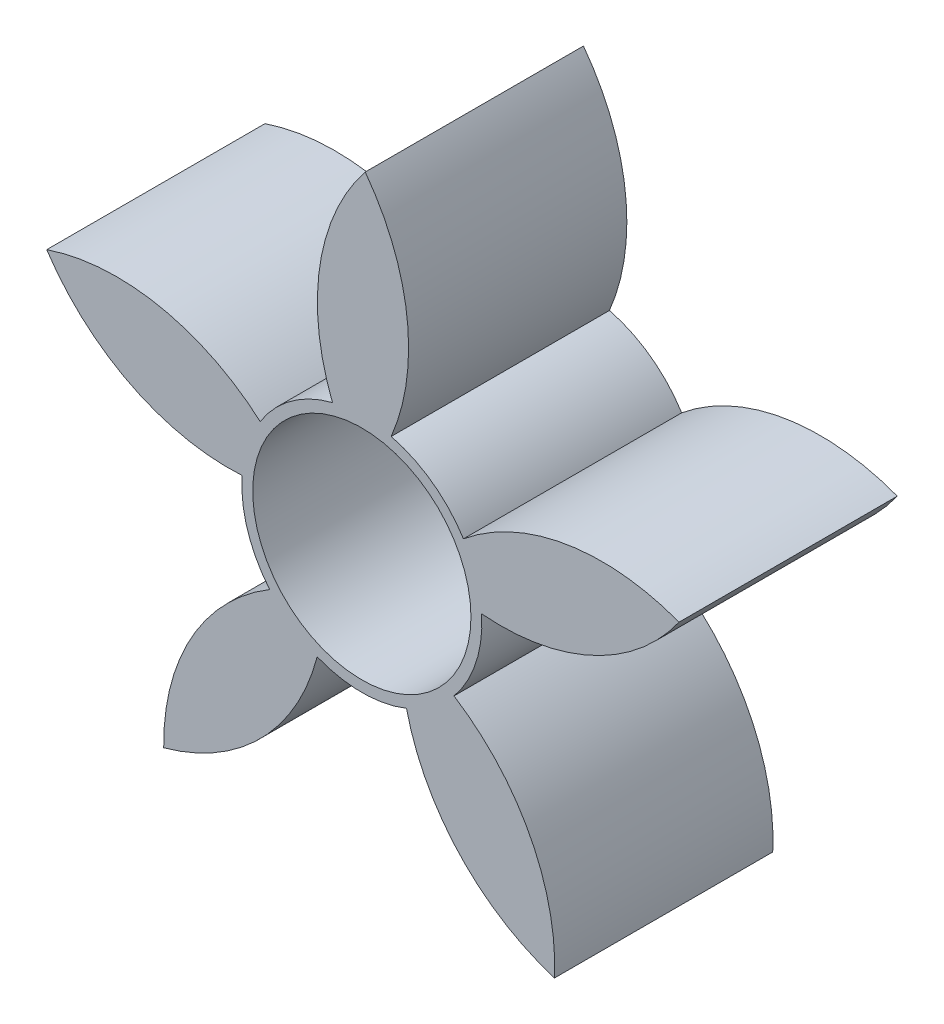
from build123d import *

# Parameters (mm, degrees)
SKETCH1_R           = 12.7
BOSS_EXTRUDE1_DEPTH = 25.4


with BuildPart() as part:
    # Sketch1 → Boss-Extrude1 (new body)
    with BuildSketch(Plane.XY):
        with BuildLine():
            ThreePointArc((11.827189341, 7.434950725), (8.211359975, 11.301967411), (3.416255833, 13.545851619))
            ThreePointArc((3.416255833, 13.545851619), (5.26240015, 26.522066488), (0.393488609, 38.691047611))
            ThreePointArc((0.393488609, 38.691047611), (-4.885128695, 26.629605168), (-3.416255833, 13.545851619))
            ThreePointArc((-3.416255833, 13.545851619), (-8.211359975, 11.301967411), (-11.827189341, 7.434950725))
            ThreePointArc((-11.827189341, 7.434950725), (-23.597813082, 13.200609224), (-36.675778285, 12.330421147))
            ThreePointArc((-36.675778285, 12.330421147), (-26.835847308, 3.582967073), (-13.938551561, 0.936845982))
            ThreePointArc((-13.938551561, 0.936845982), (-13.286259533, -4.316967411), (-10.725860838, -8.950799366))
            ThreePointArc((-10.725860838, -8.950799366), (-19.846650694, -18.363641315), (-23.060366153, -31.070428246))
            ThreePointArc((-23.060366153, -31.070428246), (-11.700337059, -24.415209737), (-5.198242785, -12.96684896))
            ThreePointArc((-5.198242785, -12.96684896), (0, -13.97), (5.198242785, -12.96684896))
            ThreePointArc((5.198242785, -12.96684896), (11.33190839, -24.549963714), (22.42368821, -31.533001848))
            ThreePointArc((22.42368821, -31.533001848), (19.604641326, -18.672396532), (10.725860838, -8.950799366))
            ThreePointArc((10.725860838, -8.950799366), (13.286259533, -4.316967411), (13.938551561, 0.936845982))
            ThreePointArc((13.938551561, 0.936845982), (26.850155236, 3.190929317), (36.91896762, 11.581961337))
            ThreePointArc((36.91896762, 11.581961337), (23.816671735, 12.875034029), (11.827189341, 7.434950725))
        make_face()
        Circle(SKETCH1_R, mode=Mode.SUBTRACT)
    extrude(amount=BOSS_EXTRUDE1_DEPTH)


solid = part.part
